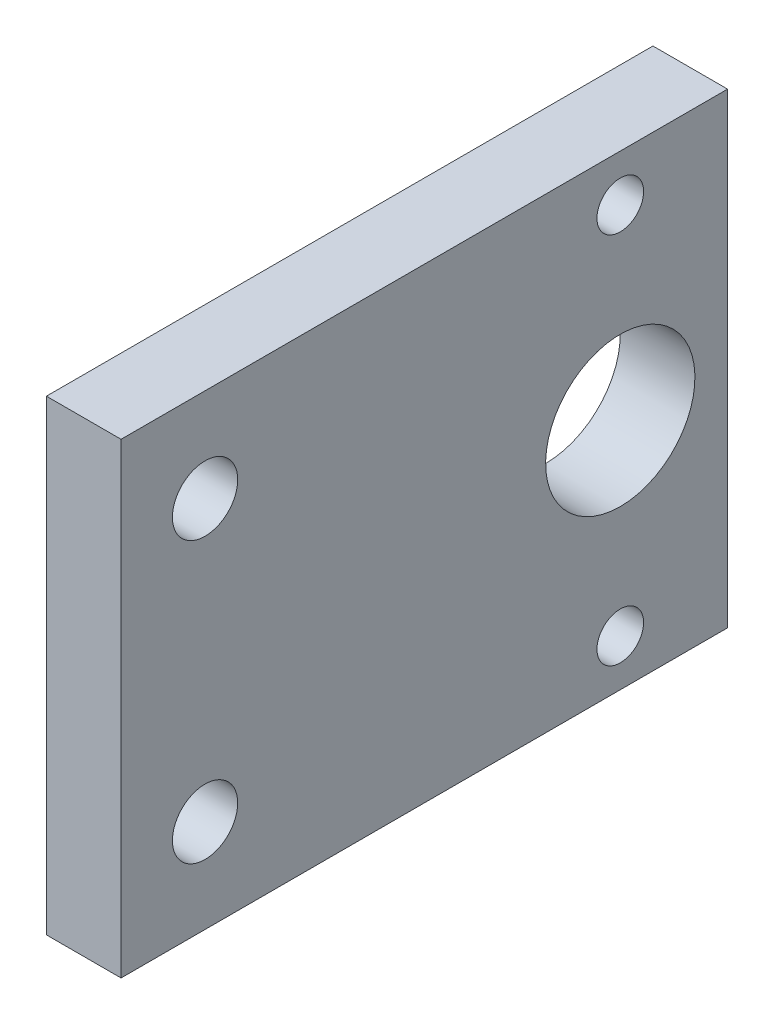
ISO-10303-21;
HEADER;
FILE_DESCRIPTION(('STEP AP214'),'2;1');
FILE_NAME('part.step','',(''),(''),'','','');
FILE_SCHEMA(('AUTOMOTIVE_DESIGN { 1 0 10303 214 1 1 1 1 }'));
ENDSEC;
DATA;
#1=APPLICATION_CONTEXT('core data for automotive mechanical design processes');
#2=APPLICATION_PROTOCOL_DEFINITION('international standard','automotive_design',2000,#1);
#3=PRODUCT_CONTEXT('',#1,'mechanical');
#4=PRODUCT('Part','Part','',(#3));
#5=PRODUCT_RELATED_PRODUCT_CATEGORY('part','',(#4));
#6=PRODUCT_DEFINITION_FORMATION('','',#4);
#7=PRODUCT_DEFINITION_CONTEXT('part definition',#1,'design');
#8=PRODUCT_DEFINITION('design','',#6,#7);
#9=PRODUCT_DEFINITION_SHAPE('','',#8);
#10=(LENGTH_UNIT() NAMED_UNIT(*) SI_UNIT(.MILLI.,.METRE.));
#11=(NAMED_UNIT(*) PLANE_ANGLE_UNIT() SI_UNIT($,.RADIAN.));
#12=(NAMED_UNIT(*) SI_UNIT($,.STERADIAN.) SOLID_ANGLE_UNIT());
#13=UNCERTAINTY_MEASURE_WITH_UNIT(LENGTH_MEASURE(1.E-05),#10,'distance_accuracy_value','');
#14=(GEOMETRIC_REPRESENTATION_CONTEXT(3) GLOBAL_UNCERTAINTY_ASSIGNED_CONTEXT((#13)) GLOBAL_UNIT_ASSIGNED_CONTEXT((#10,
#11,#12)) REPRESENTATION_CONTEXT('',''));
#15=CARTESIAN_POINT('',(0.,0.,0.));
#16=DIRECTION('',(0.,0.,1.));
#17=DIRECTION('',(1.,0.,0.));
#18=AXIS2_PLACEMENT_3D('',#15,#16,#17);
#19=CARTESIAN_POINT('',(4.00000000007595,20.,-16.9999999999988));
#20=DIRECTION('',(-1.,0.,0.));
#21=DIRECTION('',(0.,0.,1.));
#22=AXIS2_PLACEMENT_3D('',#19,#20,#21);
#23=CONICAL_SURFACE('',#22,3.44999999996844,1.04719755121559);
#24=CARTESIAN_POINT('',(4.00000000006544,20.,-16.9999999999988));
#25=DIRECTION('',(-1.,0.,0.));
#26=DIRECTION('',(0.,0.,1.));
#27=AXIS2_PLACEMENT_3D('',#24,#25,#26);
#28=CIRCLE('',#27,3.44999999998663);
#29=CARTESIAN_POINT('',(4.00000000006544,20.,-13.5500000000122));
#30=VERTEX_POINT('',#29);
#31=EDGE_CURVE('E115',#30,#30,#28,.F.);
#32=ORIENTED_EDGE('',*,*,#31,.F.);
#33=EDGE_LOOP('',(#32));
#34=FACE_BOUND('',#33,.T.);
#35=CARTESIAN_POINT('',(4.54848275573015,20.,-16.9999999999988));
#36=DIRECTION('',(-1.,0.,0.));
#37=DIRECTION('',(0.,-1.,0.));
#38=AXIS2_PLACEMENT_3D('',#35,#36,#37);
#39=CIRCLE('',#38,2.5);
#40=CARTESIAN_POINT('',(4.54848275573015,17.5,-16.9999999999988));
#41=VERTEX_POINT('',#40);
#42=EDGE_CURVE('E103',#41,#41,#39,.F.);
#43=ORIENTED_EDGE('',*,*,#42,.T.);
#44=EDGE_LOOP('',(#43));
#45=FACE_BOUND('',#44,.T.);
#46=ADVANCED_FACE('F16',(#34,#45),#23,.F.);
#47=CARTESIAN_POINT('',(4.00000000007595,-20.,-16.9999999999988));
#48=DIRECTION('',(-1.,0.,0.));
#49=DIRECTION('',(0.,0.,1.));
#50=AXIS2_PLACEMENT_3D('',#47,#48,#49);
#51=CONICAL_SURFACE('',#50,3.44999999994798,1.04719755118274);
#52=CARTESIAN_POINT('',(3.99999999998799,-20.,-16.9999999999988));
#53=DIRECTION('',(-1.,0.,0.));
#54=DIRECTION('',(0.,0.,1.));
#55=AXIS2_PLACEMENT_3D('',#52,#53,#54);
#56=CIRCLE('',#55,3.45000000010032);
#57=CARTESIAN_POINT('',(3.99999999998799,-20.,-13.5499999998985));
#58=VERTEX_POINT('',#57);
#59=EDGE_CURVE('E19',#58,#58,#56,.F.);
#60=ORIENTED_EDGE('',*,*,#59,.F.);
#61=EDGE_LOOP('',(#60));
#62=FACE_BOUND('',#61,.T.);
#63=CARTESIAN_POINT('',(4.54848275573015,-20.,-16.9999999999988));
#64=DIRECTION('',(-1.,0.,0.));
#65=DIRECTION('',(0.,-1.,0.));
#66=AXIS2_PLACEMENT_3D('',#63,#64,#65);
#67=CIRCLE('',#66,2.5);
#68=CARTESIAN_POINT('',(4.54848275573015,-22.5,-16.9999999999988));
#69=VERTEX_POINT('',#68);
#70=EDGE_CURVE('E100',#69,#69,#67,.F.);
#71=ORIENTED_EDGE('',*,*,#70,.T.);
#72=EDGE_LOOP('',(#71));
#73=FACE_BOUND('',#72,.T.);
#74=ADVANCED_FACE('F123',(#62,#73),#51,.F.);
#75=CARTESIAN_POINT('',(4.,0.,0.));
#76=DIRECTION('',(-1.,0.,0.));
#77=DIRECTION('',(0.,0.,1.));
#78=AXIS2_PLACEMENT_3D('',#75,#76,#77);
#79=PLANE('',#78);
#80=CARTESIAN_POINT('',(3.99999999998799,-15.,27.5));
#81=DIRECTION('',(1.,0.,0.));
#82=DIRECTION('',(0.,0.,-1.));
#83=AXIS2_PLACEMENT_3D('',#80,#81,#82);
#84=CIRCLE('',#83,3.5);
#85=CARTESIAN_POINT('',(3.99999999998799,-15.,24.));
#86=VERTEX_POINT('',#85);
#87=EDGE_CURVE('E258',#86,#86,#84,.T.);
#88=ORIENTED_EDGE('',*,*,#87,.T.);
#89=EDGE_LOOP('',(#88));
#90=FACE_BOUND('',#89,.T.);
#91=CARTESIAN_POINT('',(3.99999999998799,15.,27.5));
#92=DIRECTION('',(1.,0.,0.));
#93=DIRECTION('',(0.,0.,-1.));
#94=AXIS2_PLACEMENT_3D('',#91,#92,#93);
#95=CIRCLE('',#94,3.5);
#96=CARTESIAN_POINT('',(3.99999999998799,15.,24.));
#97=VERTEX_POINT('',#96);
#98=EDGE_CURVE('E80',#97,#97,#95,.T.);
#99=ORIENTED_EDGE('',*,*,#98,.T.);
#100=EDGE_LOOP('',(#99));
#101=FACE_BOUND('',#100,.T.);
#102=DIRECTION('',(0.,0.,1.));
#103=VECTOR('',#102,1.);
#104=CARTESIAN_POINT('',(4.,-25.,-35.));
#105=LINE('',#104,#103);
#106=CARTESIAN_POINT('',(4.,-25.,-28.4999999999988));
#107=VERTEX_POINT('',#106);
#108=CARTESIAN_POINT('',(4.,-25.,36.5));
#109=VERTEX_POINT('',#108);
#110=EDGE_CURVE('E63',#107,#109,#105,.T.);
#111=ORIENTED_EDGE('',*,*,#110,.T.);
#112=DIRECTION('',(0.,-1.,0.));
#113=VECTOR('',#112,1.);
#114=CARTESIAN_POINT('',(4.,25.,36.5));
#115=LINE('',#114,#113);
#116=CARTESIAN_POINT('',(4.,25.,36.5));
#117=VERTEX_POINT('',#116);
#118=EDGE_CURVE('E68',#117,#109,#115,.T.);
#119=ORIENTED_EDGE('',*,*,#118,.F.);
#120=DIRECTION('',(0.,0.,-1.));
#121=VECTOR('',#120,1.);
#122=CARTESIAN_POINT('',(4.,25.,-35.));
#123=LINE('',#122,#121);
#124=CARTESIAN_POINT('',(4.,25.,-28.4999999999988));
#125=VERTEX_POINT('',#124);
#126=EDGE_CURVE('E54',#117,#125,#123,.T.);
#127=ORIENTED_EDGE('',*,*,#126,.T.);
#128=DIRECTION('',(0.,1.,0.));
#129=VECTOR('',#128,1.);
#130=CARTESIAN_POINT('',(4.,15.,-28.4999999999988));
#131=LINE('',#130,#129);
#132=EDGE_CURVE('E44',#125,#107,#131,.F.);
#133=ORIENTED_EDGE('',*,*,#132,.T.);
#134=EDGE_LOOP('',(#111,#119,#127,#133));
#135=FACE_BOUND('',#134,.T.);
#136=ORIENTED_EDGE('',*,*,#31,.T.);
#137=EDGE_LOOP('',(#136));
#138=FACE_BOUND('',#137,.T.);
#139=ORIENTED_EDGE('',*,*,#59,.T.);
#140=EDGE_LOOP('',(#139));
#141=FACE_BOUND('',#140,.T.);
#142=CARTESIAN_POINT('',(4.,-7.94031507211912E-13,-16.9999999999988));
#143=DIRECTION('',(-1.,0.,0.));
#144=DIRECTION('',(0.,-1.,0.));
#145=AXIS2_PLACEMENT_3D('',#142,#143,#144);
#146=CIRCLE('',#145,8.);
#147=CARTESIAN_POINT('',(4.,-8.00000000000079,-16.9999999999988));
#148=VERTEX_POINT('',#147);
#149=EDGE_CURVE('E106',#148,#148,#146,.F.);
#150=ORIENTED_EDGE('',*,*,#149,.T.);
#151=EDGE_LOOP('',(#150));
#152=FACE_BOUND('',#151,.T.);
#153=ADVANCED_FACE('F65',(#90,#101,#135,#138,#141,#152),#79,.T.);
#154=CARTESIAN_POINT('',(4.,-7.94031507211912E-13,-16.9999999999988));
#155=DIRECTION('',(-1.,0.,0.));
#156=DIRECTION('',(0.,-1.,0.));
#157=AXIS2_PLACEMENT_3D('',#154,#155,#156);
#158=CYLINDRICAL_SURFACE('',#157,8.);
#159=CARTESIAN_POINT('',(12.,-7.94031507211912E-13,-16.9999999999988));
#160=DIRECTION('',(-1.,0.,0.));
#161=DIRECTION('',(0.,-1.,0.));
#162=AXIS2_PLACEMENT_3D('',#159,#160,#161);
#163=CIRCLE('',#162,8.);
#164=CARTESIAN_POINT('',(12.,-8.00000000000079,-16.9999999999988));
#165=VERTEX_POINT('',#164);
#166=EDGE_CURVE('E96',#165,#165,#163,.F.);
#167=ORIENTED_EDGE('',*,*,#166,.T.);
#168=EDGE_LOOP('',(#167));
#169=FACE_BOUND('',#168,.T.);
#170=ORIENTED_EDGE('',*,*,#149,.F.);
#171=EDGE_LOOP('',(#170));
#172=FACE_BOUND('',#171,.T.);
#173=ADVANCED_FACE('F141',(#169,#172),#158,.F.);
#174=CARTESIAN_POINT('',(3.99999999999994,20.,-16.9999999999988));
#175=DIRECTION('',(-1.,0.,0.));
#176=DIRECTION('',(0.,-1.,0.));
#177=AXIS2_PLACEMENT_3D('',#174,#175,#176);
#178=CYLINDRICAL_SURFACE('',#177,2.5);
#179=CARTESIAN_POINT('',(12.,20.,-16.9999999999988));
#180=DIRECTION('',(-1.,0.,0.));
#181=DIRECTION('',(0.,-1.,0.));
#182=AXIS2_PLACEMENT_3D('',#179,#180,#181);
#183=CIRCLE('',#182,2.5);
#184=CARTESIAN_POINT('',(12.,17.5,-16.9999999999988));
#185=VERTEX_POINT('',#184);
#186=EDGE_CURVE('E109',#185,#185,#183,.F.);
#187=ORIENTED_EDGE('',*,*,#186,.T.);
#188=EDGE_LOOP('',(#187));
#189=FACE_BOUND('',#188,.T.);
#190=ORIENTED_EDGE('',*,*,#42,.F.);
#191=EDGE_LOOP('',(#190));
#192=FACE_BOUND('',#191,.T.);
#193=ADVANCED_FACE('F131',(#189,#192),#178,.F.);
#194=CARTESIAN_POINT('',(4.,-20.,-16.9999999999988));
#195=DIRECTION('',(-1.,0.,0.));
#196=DIRECTION('',(0.,-1.,0.));
#197=AXIS2_PLACEMENT_3D('',#194,#195,#196);
#198=CYLINDRICAL_SURFACE('',#197,2.5);
#199=CARTESIAN_POINT('',(12.,-20.,-16.9999999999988));
#200=DIRECTION('',(-1.,0.,0.));
#201=DIRECTION('',(0.,-1.,0.));
#202=AXIS2_PLACEMENT_3D('',#199,#200,#201);
#203=CIRCLE('',#202,2.5);
#204=CARTESIAN_POINT('',(12.,-22.5,-16.9999999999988));
#205=VERTEX_POINT('',#204);
#206=EDGE_CURVE('E93',#205,#205,#203,.F.);
#207=ORIENTED_EDGE('',*,*,#206,.T.);
#208=EDGE_LOOP('',(#207));
#209=FACE_BOUND('',#208,.T.);
#210=ORIENTED_EDGE('',*,*,#70,.F.);
#211=EDGE_LOOP('',(#210));
#212=FACE_BOUND('',#211,.T.);
#213=ADVANCED_FACE('F128',(#209,#212),#198,.F.);
#214=CARTESIAN_POINT('',(13.,15.,-28.4999999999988));
#215=DIRECTION('',(0.,0.,1.));
#216=DIRECTION('',(1.,0.,0.));
#217=AXIS2_PLACEMENT_3D('',#214,#215,#216);
#218=PLANE('',#217);
#219=DIRECTION('',(1.,0.,0.));
#220=VECTOR('',#219,1.);
#221=CARTESIAN_POINT('',(13.,-25.,-28.4999999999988));
#222=LINE('',#221,#220);
#223=CARTESIAN_POINT('',(12.,-25.,-28.4999999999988));
#224=VERTEX_POINT('',#223);
#225=EDGE_CURVE('E34',#224,#107,#222,.F.);
#226=ORIENTED_EDGE('',*,*,#225,.T.);
#227=ORIENTED_EDGE('',*,*,#132,.F.);
#228=DIRECTION('',(1.,0.,0.));
#229=VECTOR('',#228,1.);
#230=CARTESIAN_POINT('',(13.,25.,-28.4999999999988));
#231=LINE('',#230,#229);
#232=CARTESIAN_POINT('',(12.,25.,-28.4999999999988));
#233=VERTEX_POINT('',#232);
#234=EDGE_CURVE('E94',#125,#233,#231,.T.);
#235=ORIENTED_EDGE('',*,*,#234,.T.);
#236=DIRECTION('',(0.,1.,0.));
#237=VECTOR('',#236,1.);
#238=CARTESIAN_POINT('',(12.,0.,-28.4999999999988));
#239=LINE('',#238,#237);
#240=EDGE_CURVE('E90',#233,#224,#239,.F.);
#241=ORIENTED_EDGE('',*,*,#240,.T.);
#242=EDGE_LOOP('',(#226,#227,#235,#241));
#243=FACE_BOUND('',#242,.T.);
#244=ADVANCED_FACE('F130',(#243),#218,.F.);
#245=CARTESIAN_POINT('',(13.,-25.,-35.));
#246=DIRECTION('',(0.,1.,0.));
#247=DIRECTION('',(0.,0.,1.));
#248=AXIS2_PLACEMENT_3D('',#245,#246,#247);
#249=PLANE('',#248);
#250=DIRECTION('',(0.,0.,1.));
#251=VECTOR('',#250,1.);
#252=CARTESIAN_POINT('',(12.,-25.,0.));
#253=LINE('',#252,#251);
#254=CARTESIAN_POINT('',(12.,-25.,36.5));
#255=VERTEX_POINT('',#254);
#256=EDGE_CURVE('E25',#224,#255,#253,.T.);
#257=ORIENTED_EDGE('',*,*,#256,.T.);
#258=DIRECTION('',(1.,0.,0.));
#259=VECTOR('',#258,1.);
#260=CARTESIAN_POINT('',(4.,-25.,36.5));
#261=LINE('',#260,#259);
#262=EDGE_CURVE('E71',#109,#255,#261,.T.);
#263=ORIENTED_EDGE('',*,*,#262,.F.);
#264=ORIENTED_EDGE('',*,*,#110,.F.);
#265=ORIENTED_EDGE('',*,*,#225,.F.);
#266=EDGE_LOOP('',(#257,#263,#264,#265));
#267=FACE_BOUND('',#266,.T.);
#268=ADVANCED_FACE('F72',(#267),#249,.F.);
#269=CARTESIAN_POINT('',(13.,25.,-35.));
#270=DIRECTION('',(0.,-1.,0.));
#271=DIRECTION('',(0.,0.,-1.));
#272=AXIS2_PLACEMENT_3D('',#269,#270,#271);
#273=PLANE('',#272);
#274=ORIENTED_EDGE('',*,*,#126,.F.);
#275=DIRECTION('',(-1.,0.,0.));
#276=VECTOR('',#275,1.);
#277=CARTESIAN_POINT('',(12.,25.,36.5));
#278=LINE('',#277,#276);
#279=CARTESIAN_POINT('',(12.,25.,36.5));
#280=VERTEX_POINT('',#279);
#281=EDGE_CURVE('E79',#280,#117,#278,.T.);
#282=ORIENTED_EDGE('',*,*,#281,.F.);
#283=DIRECTION('',(0.,0.,1.));
#284=VECTOR('',#283,1.);
#285=CARTESIAN_POINT('',(12.,25.,0.));
#286=LINE('',#285,#284);
#287=EDGE_CURVE('E11',#280,#233,#286,.F.);
#288=ORIENTED_EDGE('',*,*,#287,.T.);
#289=ORIENTED_EDGE('',*,*,#234,.F.);
#290=EDGE_LOOP('',(#274,#282,#288,#289));
#291=FACE_BOUND('',#290,.T.);
#292=ADVANCED_FACE('F146',(#291),#273,.F.);
#293=CARTESIAN_POINT('',(12.,0.,0.));
#294=DIRECTION('',(-1.,0.,0.));
#295=DIRECTION('',(0.,0.,1.));
#296=AXIS2_PLACEMENT_3D('',#293,#294,#295);
#297=PLANE('',#296);
#298=CARTESIAN_POINT('',(12.,-15.,27.5));
#299=DIRECTION('',(1.,0.,0.));
#300=DIRECTION('',(0.,0.,-1.));
#301=AXIS2_PLACEMENT_3D('',#298,#299,#300);
#302=CIRCLE('',#301,3.5);
#303=CARTESIAN_POINT('',(12.,-15.,24.));
#304=VERTEX_POINT('',#303);
#305=EDGE_CURVE('E263',#304,#304,#302,.T.);
#306=ORIENTED_EDGE('',*,*,#305,.F.);
#307=EDGE_LOOP('',(#306));
#308=FACE_BOUND('',#307,.T.);
#309=CARTESIAN_POINT('',(12.,15.,27.5));
#310=DIRECTION('',(1.,0.,0.));
#311=DIRECTION('',(0.,0.,-1.));
#312=AXIS2_PLACEMENT_3D('',#309,#310,#311);
#313=CIRCLE('',#312,3.5);
#314=CARTESIAN_POINT('',(12.,15.,24.));
#315=VERTEX_POINT('',#314);
#316=EDGE_CURVE('E83',#315,#315,#313,.T.);
#317=ORIENTED_EDGE('',*,*,#316,.F.);
#318=EDGE_LOOP('',(#317));
#319=FACE_BOUND('',#318,.T.);
#320=ORIENTED_EDGE('',*,*,#287,.F.);
#321=DIRECTION('',(0.,1.,0.));
#322=VECTOR('',#321,1.);
#323=CARTESIAN_POINT('',(12.,-25.,36.5));
#324=LINE('',#323,#322);
#325=EDGE_CURVE('E76',#255,#280,#324,.T.);
#326=ORIENTED_EDGE('',*,*,#325,.F.);
#327=ORIENTED_EDGE('',*,*,#256,.F.);
#328=ORIENTED_EDGE('',*,*,#240,.F.);
#329=EDGE_LOOP('',(#320,#326,#327,#328));
#330=FACE_BOUND('',#329,.T.);
#331=ORIENTED_EDGE('',*,*,#206,.F.);
#332=EDGE_LOOP('',(#331));
#333=FACE_BOUND('',#332,.T.);
#334=ORIENTED_EDGE('',*,*,#186,.F.);
#335=EDGE_LOOP('',(#334));
#336=FACE_BOUND('',#335,.T.);
#337=ORIENTED_EDGE('',*,*,#166,.F.);
#338=EDGE_LOOP('',(#337));
#339=FACE_BOUND('',#338,.T.);
#340=ADVANCED_FACE('F144',(#308,#319,#330,#333,#336,#339),#297,.F.);
#341=CARTESIAN_POINT('',(0.,0.,36.5));
#342=DIRECTION('',(0.,0.,1.));
#343=DIRECTION('',(1.,0.,0.));
#344=AXIS2_PLACEMENT_3D('',#341,#342,#343);
#345=PLANE('',#344);
#346=ORIENTED_EDGE('',*,*,#118,.T.);
#347=ORIENTED_EDGE('',*,*,#262,.T.);
#348=ORIENTED_EDGE('',*,*,#325,.T.);
#349=ORIENTED_EDGE('',*,*,#281,.T.);
#350=EDGE_LOOP('',(#346,#347,#348,#349));
#351=FACE_BOUND('',#350,.T.);
#352=ADVANCED_FACE('F78',(#351),#345,.T.);
#353=CARTESIAN_POINT('',(3.99999999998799,15.,27.5));
#354=DIRECTION('',(1.,0.,0.));
#355=DIRECTION('',(0.,0.,-1.));
#356=AXIS2_PLACEMENT_3D('',#353,#354,#355);
#357=CYLINDRICAL_SURFACE('',#356,3.5);
#358=ORIENTED_EDGE('',*,*,#98,.F.);
#359=EDGE_LOOP('',(#358));
#360=FACE_BOUND('',#359,.T.);
#361=ORIENTED_EDGE('',*,*,#316,.T.);
#362=EDGE_LOOP('',(#361));
#363=FACE_BOUND('',#362,.T.);
#364=ADVANCED_FACE('F154',(#360,#363),#357,.F.);
#365=CARTESIAN_POINT('',(3.99999999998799,-15.,27.5));
#366=DIRECTION('',(1.,0.,0.));
#367=DIRECTION('',(0.,0.,-1.));
#368=AXIS2_PLACEMENT_3D('',#365,#366,#367);
#369=CYLINDRICAL_SURFACE('',#368,3.5);
#370=ORIENTED_EDGE('',*,*,#87,.F.);
#371=EDGE_LOOP('',(#370));
#372=FACE_BOUND('',#371,.T.);
#373=ORIENTED_EDGE('',*,*,#305,.T.);
#374=EDGE_LOOP('',(#373));
#375=FACE_BOUND('',#374,.T.);
#376=ADVANCED_FACE('F196',(#372,#375),#369,.F.);
#377=CLOSED_SHELL('',(#46,#74,#153,#173,#193,#213,#244,#268,#292,#340,#352,#364,#376));
#378=MANIFOLD_SOLID_BREP('B1',#377);
#379=ADVANCED_BREP_SHAPE_REPRESENTATION('',(#18,#378),#14);
#380=SHAPE_DEFINITION_REPRESENTATION(#9,#379);
ENDSEC;
END-ISO-10303-21;
